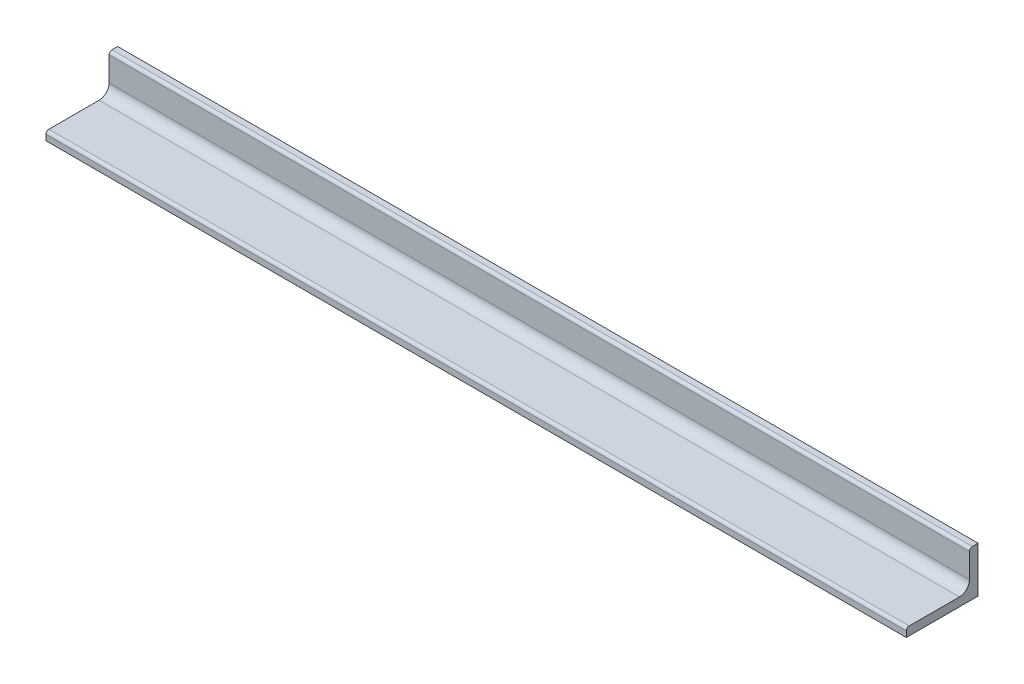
ISO-10303-21;
HEADER;
FILE_DESCRIPTION(('STEP AP214'),'2;1');
FILE_NAME('part.step','',(''),(''),'','','');
FILE_SCHEMA(('AUTOMOTIVE_DESIGN { 1 0 10303 214 1 1 1 1 }'));
ENDSEC;
DATA;
#1=APPLICATION_CONTEXT('core data for automotive mechanical design processes');
#2=APPLICATION_PROTOCOL_DEFINITION('international standard','automotive_design',2000,#1);
#3=PRODUCT_CONTEXT('',#1,'mechanical');
#4=PRODUCT('Part','Part','',(#3));
#5=PRODUCT_RELATED_PRODUCT_CATEGORY('part','',(#4));
#6=PRODUCT_DEFINITION_FORMATION('','',#4);
#7=PRODUCT_DEFINITION_CONTEXT('part definition',#1,'design');
#8=PRODUCT_DEFINITION('design','',#6,#7);
#9=PRODUCT_DEFINITION_SHAPE('','',#8);
#10=(LENGTH_UNIT() NAMED_UNIT(*) SI_UNIT(.MILLI.,.METRE.));
#11=(NAMED_UNIT(*) PLANE_ANGLE_UNIT() SI_UNIT($,.RADIAN.));
#12=(NAMED_UNIT(*) SI_UNIT($,.STERADIAN.) SOLID_ANGLE_UNIT());
#13=UNCERTAINTY_MEASURE_WITH_UNIT(LENGTH_MEASURE(1.E-05),#10,'distance_accuracy_value','');
#14=(GEOMETRIC_REPRESENTATION_CONTEXT(3) GLOBAL_UNCERTAINTY_ASSIGNED_CONTEXT((#13)) GLOBAL_UNIT_ASSIGNED_CONTEXT((#10,
#11,#12)) REPRESENTATION_CONTEXT('',''));
#15=CARTESIAN_POINT('',(0.,0.,0.));
#16=DIRECTION('',(0.,0.,1.));
#17=DIRECTION('',(1.,0.,0.));
#18=AXIS2_PLACEMENT_3D('',#15,#16,#17);
#19=CARTESIAN_POINT('',(300.,0.,25.));
#20=DIRECTION('',(0.,0.,-1.));
#21=DIRECTION('',(0.,1.,0.));
#22=AXIS2_PLACEMENT_3D('',#19,#20,#21);
#23=PLANE('',#22);
#24=DIRECTION('',(0.,-1.,0.));
#25=VECTOR('',#24,1.);
#26=CARTESIAN_POINT('',(0.,0.,25.));
#27=LINE('',#26,#25);
#28=CARTESIAN_POINT('',(0.,2.,25.));
#29=VERTEX_POINT('',#28);
#30=CARTESIAN_POINT('',(0.,0.,25.));
#31=VERTEX_POINT('',#30);
#32=EDGE_CURVE('E135',#29,#31,#27,.T.);
#33=ORIENTED_EDGE('',*,*,#32,.T.);
#34=DIRECTION('',(-1.,0.,0.));
#35=VECTOR('',#34,1.);
#36=CARTESIAN_POINT('',(300.,0.,25.));
#37=LINE('',#36,#35);
#38=CARTESIAN_POINT('',(300.,0.,25.));
#39=VERTEX_POINT('',#38);
#40=EDGE_CURVE('E11',#39,#31,#37,.T.);
#41=ORIENTED_EDGE('',*,*,#40,.F.);
#42=DIRECTION('',(0.,-1.,0.));
#43=VECTOR('',#42,1.);
#44=CARTESIAN_POINT('',(300.,0.,25.));
#45=LINE('',#44,#43);
#46=CARTESIAN_POINT('',(300.,2.,25.));
#47=VERTEX_POINT('',#46);
#48=EDGE_CURVE('E151',#47,#39,#45,.T.);
#49=ORIENTED_EDGE('',*,*,#48,.F.);
#50=DIRECTION('',(-1.,0.,0.));
#51=VECTOR('',#50,1.);
#52=CARTESIAN_POINT('',(300.,2.,25.));
#53=LINE('',#52,#51);
#54=EDGE_CURVE('E131',#47,#29,#53,.T.);
#55=ORIENTED_EDGE('',*,*,#54,.T.);
#56=EDGE_LOOP('',(#33,#41,#49,#55));
#57=FACE_BOUND('',#56,.T.);
#58=ADVANCED_FACE('F33',(#57),#23,.F.);
#59=CARTESIAN_POINT('',(300.,0.,25.));
#60=DIRECTION('',(0.,1.,0.));
#61=DIRECTION('',(0.,0.,1.));
#62=AXIS2_PLACEMENT_3D('',#59,#60,#61);
#63=PLANE('',#62);
#64=DIRECTION('',(0.,0.,-1.));
#65=VECTOR('',#64,1.);
#66=CARTESIAN_POINT('',(0.,0.,25.));
#67=LINE('',#66,#65);
#68=CARTESIAN_POINT('',(0.,0.,0.));
#69=VERTEX_POINT('',#68);
#70=EDGE_CURVE('E138',#31,#69,#67,.T.);
#71=ORIENTED_EDGE('',*,*,#70,.T.);
#72=DIRECTION('',(-1.,0.,0.));
#73=VECTOR('',#72,1.);
#74=CARTESIAN_POINT('',(300.,0.,0.));
#75=LINE('',#74,#73);
#76=CARTESIAN_POINT('',(300.,0.,0.));
#77=VERTEX_POINT('',#76);
#78=EDGE_CURVE('E41',#77,#69,#75,.T.);
#79=ORIENTED_EDGE('',*,*,#78,.F.);
#80=DIRECTION('',(0.,0.,-1.));
#81=VECTOR('',#80,1.);
#82=CARTESIAN_POINT('',(300.,0.,25.));
#83=LINE('',#82,#81);
#84=EDGE_CURVE('E95',#39,#77,#83,.T.);
#85=ORIENTED_EDGE('',*,*,#84,.F.);
#86=ORIENTED_EDGE('',*,*,#40,.T.);
#87=EDGE_LOOP('',(#71,#79,#85,#86));
#88=FACE_BOUND('',#87,.T.);
#89=ADVANCED_FACE('F194',(#88),#63,.F.);
#90=CARTESIAN_POINT('',(300.,0.,0.));
#91=DIRECTION('',(0.,0.,1.));
#92=DIRECTION('',(1.,0.,0.));
#93=AXIS2_PLACEMENT_3D('',#90,#91,#92);
#94=PLANE('',#93);
#95=DIRECTION('',(0.,1.,0.));
#96=VECTOR('',#95,1.);
#97=CARTESIAN_POINT('',(0.,0.,0.));
#98=LINE('',#97,#96);
#99=CARTESIAN_POINT('',(0.,16.,0.));
#100=VERTEX_POINT('',#99);
#101=EDGE_CURVE('E140',#69,#100,#98,.T.);
#102=ORIENTED_EDGE('',*,*,#101,.T.);
#103=DIRECTION('',(-1.,0.,0.));
#104=VECTOR('',#103,1.);
#105=CARTESIAN_POINT('',(300.,16.,0.));
#106=LINE('',#105,#104);
#107=CARTESIAN_POINT('',(300.,16.,0.));
#108=VERTEX_POINT('',#107);
#109=EDGE_CURVE('E161',#108,#100,#106,.T.);
#110=ORIENTED_EDGE('',*,*,#109,.F.);
#111=DIRECTION('',(0.,1.,0.));
#112=VECTOR('',#111,1.);
#113=CARTESIAN_POINT('',(300.,0.,0.));
#114=LINE('',#113,#112);
#115=EDGE_CURVE('E169',#77,#108,#114,.T.);
#116=ORIENTED_EDGE('',*,*,#115,.F.);
#117=ORIENTED_EDGE('',*,*,#78,.T.);
#118=EDGE_LOOP('',(#102,#110,#116,#117));
#119=FACE_BOUND('',#118,.T.);
#120=ADVANCED_FACE('F167',(#119),#94,.F.);
#121=CARTESIAN_POINT('',(300.,16.,0.));
#122=DIRECTION('',(0.,-1.,0.));
#123=DIRECTION('',(0.,0.,-1.));
#124=AXIS2_PLACEMENT_3D('',#121,#122,#123);
#125=PLANE('',#124);
#126=DIRECTION('',(0.,0.,1.));
#127=VECTOR('',#126,1.);
#128=CARTESIAN_POINT('',(0.,16.,0.));
#129=LINE('',#128,#127);
#130=CARTESIAN_POINT('',(0.,16.,2.));
#131=VERTEX_POINT('',#130);
#132=EDGE_CURVE('E142',#100,#131,#129,.T.);
#133=ORIENTED_EDGE('',*,*,#132,.T.);
#134=DIRECTION('',(-1.,0.,0.));
#135=VECTOR('',#134,1.);
#136=CARTESIAN_POINT('',(300.,16.,2.));
#137=LINE('',#136,#135);
#138=CARTESIAN_POINT('',(300.,16.,2.));
#139=VERTEX_POINT('',#138);
#140=EDGE_CURVE('E158',#139,#131,#137,.T.);
#141=ORIENTED_EDGE('',*,*,#140,.F.);
#142=DIRECTION('',(0.,0.,1.));
#143=VECTOR('',#142,1.);
#144=CARTESIAN_POINT('',(300.,16.,0.));
#145=LINE('',#144,#143);
#146=EDGE_CURVE('E185',#108,#139,#145,.T.);
#147=ORIENTED_EDGE('',*,*,#146,.F.);
#148=ORIENTED_EDGE('',*,*,#109,.T.);
#149=EDGE_LOOP('',(#133,#141,#147,#148));
#150=FACE_BOUND('',#149,.T.);
#151=ADVANCED_FACE('F178',(#150),#125,.F.);
#152=CARTESIAN_POINT('',(300.,15.,2.));
#153=DIRECTION('',(-1.,0.,0.));
#154=DIRECTION('',(0.,0.,1.));
#155=AXIS2_PLACEMENT_3D('',#152,#153,#154);
#156=CYLINDRICAL_SURFACE('',#155,0.999999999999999);
#157=CARTESIAN_POINT('',(0.,15.,2.));
#158=DIRECTION('',(1.,0.,0.));
#159=DIRECTION('',(0.,0.,-1.));
#160=AXIS2_PLACEMENT_3D('',#157,#158,#159);
#161=CIRCLE('',#160,0.999999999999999);
#162=CARTESIAN_POINT('',(0.,15.,3.));
#163=VERTEX_POINT('',#162);
#164=EDGE_CURVE('E144',#131,#163,#161,.T.);
#165=ORIENTED_EDGE('',*,*,#164,.T.);
#166=DIRECTION('',(-1.,0.,0.));
#167=VECTOR('',#166,1.);
#168=CARTESIAN_POINT('',(300.,15.,3.));
#169=LINE('',#168,#167);
#170=CARTESIAN_POINT('',(300.,15.,3.));
#171=VERTEX_POINT('',#170);
#172=EDGE_CURVE('E155',#171,#163,#169,.T.);
#173=ORIENTED_EDGE('',*,*,#172,.F.);
#174=CARTESIAN_POINT('',(300.,15.,2.));
#175=DIRECTION('',(1.,0.,0.));
#176=DIRECTION('',(0.,0.,-1.));
#177=AXIS2_PLACEMENT_3D('',#174,#175,#176);
#178=CIRCLE('',#177,0.999999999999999);
#179=EDGE_CURVE('E184',#139,#171,#178,.T.);
#180=ORIENTED_EDGE('',*,*,#179,.F.);
#181=ORIENTED_EDGE('',*,*,#140,.T.);
#182=EDGE_LOOP('',(#165,#173,#180,#181));
#183=FACE_BOUND('',#182,.T.);
#184=ADVANCED_FACE('F182',(#183),#156,.T.);
#185=CARTESIAN_POINT('',(300.,6.50000000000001,2.99999999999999));
#186=DIRECTION('',(0.,0.,-1.));
#187=DIRECTION('',(0.,1.,0.));
#188=AXIS2_PLACEMENT_3D('',#185,#186,#187);
#189=PLANE('',#188);
#190=DIRECTION('',(0.,-1.,0.));
#191=VECTOR('',#190,1.);
#192=CARTESIAN_POINT('',(0.,6.50000000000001,2.99999999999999));
#193=LINE('',#192,#191);
#194=CARTESIAN_POINT('',(0.,6.50000000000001,2.99999999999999));
#195=VERTEX_POINT('',#194);
#196=EDGE_CURVE('E146',#163,#195,#193,.T.);
#197=ORIENTED_EDGE('',*,*,#196,.T.);
#198=DIRECTION('',(-1.,0.,0.));
#199=VECTOR('',#198,1.);
#200=CARTESIAN_POINT('',(300.,6.50000000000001,2.99999999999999));
#201=LINE('',#200,#199);
#202=CARTESIAN_POINT('',(300.,6.50000000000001,2.99999999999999));
#203=VERTEX_POINT('',#202);
#204=EDGE_CURVE('E126',#203,#195,#201,.T.);
#205=ORIENTED_EDGE('',*,*,#204,.F.);
#206=DIRECTION('',(0.,-1.,0.));
#207=VECTOR('',#206,1.);
#208=CARTESIAN_POINT('',(300.,6.50000000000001,2.99999999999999));
#209=LINE('',#208,#207);
#210=EDGE_CURVE('E117',#171,#203,#209,.T.);
#211=ORIENTED_EDGE('',*,*,#210,.F.);
#212=ORIENTED_EDGE('',*,*,#172,.T.);
#213=EDGE_LOOP('',(#197,#205,#211,#212));
#214=FACE_BOUND('',#213,.T.);
#215=ADVANCED_FACE('F206',(#214),#189,.F.);
#216=CARTESIAN_POINT('',(300.,6.5,6.49999999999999));
#217=DIRECTION('',(-1.,0.,0.));
#218=DIRECTION('',(0.,0.,1.));
#219=AXIS2_PLACEMENT_3D('',#216,#217,#218);
#220=CYLINDRICAL_SURFACE('',#219,3.5);
#221=CARTESIAN_POINT('',(0.,6.5,6.49999999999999));
#222=DIRECTION('',(-1.,0.,0.));
#223=DIRECTION('',(0.,0.,-1.));
#224=AXIS2_PLACEMENT_3D('',#221,#222,#223);
#225=CIRCLE('',#224,3.5);
#226=CARTESIAN_POINT('',(0.,3.,6.50000000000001));
#227=VERTEX_POINT('',#226);
#228=EDGE_CURVE('E125',#195,#227,#225,.T.);
#229=ORIENTED_EDGE('',*,*,#228,.T.);
#230=DIRECTION('',(-1.,0.,0.));
#231=VECTOR('',#230,1.);
#232=CARTESIAN_POINT('',(300.,3.,6.50000000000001));
#233=LINE('',#232,#231);
#234=CARTESIAN_POINT('',(300.,3.,6.50000000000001));
#235=VERTEX_POINT('',#234);
#236=EDGE_CURVE('E122',#235,#227,#233,.T.);
#237=ORIENTED_EDGE('',*,*,#236,.F.);
#238=CARTESIAN_POINT('',(300.,6.5,6.49999999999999));
#239=DIRECTION('',(-1.,0.,0.));
#240=DIRECTION('',(0.,0.,-1.));
#241=AXIS2_PLACEMENT_3D('',#238,#239,#240);
#242=CIRCLE('',#241,3.5);
#243=EDGE_CURVE('E111',#203,#235,#242,.T.);
#244=ORIENTED_EDGE('',*,*,#243,.F.);
#245=ORIENTED_EDGE('',*,*,#204,.T.);
#246=EDGE_LOOP('',(#229,#237,#244,#245));
#247=FACE_BOUND('',#246,.T.);
#248=ADVANCED_FACE('F123',(#247),#220,.F.);
#249=CARTESIAN_POINT('',(300.,3.,24.));
#250=DIRECTION('',(0.,-1.,0.));
#251=DIRECTION('',(0.,0.,-1.));
#252=AXIS2_PLACEMENT_3D('',#249,#250,#251);
#253=PLANE('',#252);
#254=DIRECTION('',(0.,0.,1.));
#255=VECTOR('',#254,1.);
#256=CARTESIAN_POINT('',(0.,3.,24.));
#257=LINE('',#256,#255);
#258=CARTESIAN_POINT('',(0.,3.,24.));
#259=VERTEX_POINT('',#258);
#260=EDGE_CURVE('E81',#227,#259,#257,.T.);
#261=ORIENTED_EDGE('',*,*,#260,.T.);
#262=DIRECTION('',(-1.,0.,0.));
#263=VECTOR('',#262,1.);
#264=CARTESIAN_POINT('',(300.,3.,24.));
#265=LINE('',#264,#263);
#266=CARTESIAN_POINT('',(300.,3.,24.));
#267=VERTEX_POINT('',#266);
#268=EDGE_CURVE('E127',#267,#259,#265,.T.);
#269=ORIENTED_EDGE('',*,*,#268,.F.);
#270=DIRECTION('',(0.,0.,1.));
#271=VECTOR('',#270,1.);
#272=CARTESIAN_POINT('',(300.,3.,24.));
#273=LINE('',#272,#271);
#274=EDGE_CURVE('E115',#235,#267,#273,.T.);
#275=ORIENTED_EDGE('',*,*,#274,.F.);
#276=ORIENTED_EDGE('',*,*,#236,.T.);
#277=EDGE_LOOP('',(#261,#269,#275,#276));
#278=FACE_BOUND('',#277,.T.);
#279=ADVANCED_FACE('F129',(#278),#253,.F.);
#280=CARTESIAN_POINT('',(300.,2.,24.));
#281=DIRECTION('',(-1.,0.,0.));
#282=DIRECTION('',(0.,0.,1.));
#283=AXIS2_PLACEMENT_3D('',#280,#281,#282);
#284=CYLINDRICAL_SURFACE('',#283,0.999999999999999);
#285=CARTESIAN_POINT('',(0.,2.,24.));
#286=DIRECTION('',(1.,0.,0.));
#287=DIRECTION('',(0.,0.,1.));
#288=AXIS2_PLACEMENT_3D('',#285,#286,#287);
#289=CIRCLE('',#288,0.999999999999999);
#290=EDGE_CURVE('E87',#259,#29,#289,.T.);
#291=ORIENTED_EDGE('',*,*,#290,.T.);
#292=ORIENTED_EDGE('',*,*,#54,.F.);
#293=CARTESIAN_POINT('',(300.,2.,24.));
#294=DIRECTION('',(1.,0.,0.));
#295=DIRECTION('',(0.,0.,1.));
#296=AXIS2_PLACEMENT_3D('',#293,#294,#295);
#297=CIRCLE('',#296,0.999999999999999);
#298=EDGE_CURVE('E49',#267,#47,#297,.T.);
#299=ORIENTED_EDGE('',*,*,#298,.F.);
#300=ORIENTED_EDGE('',*,*,#268,.T.);
#301=EDGE_LOOP('',(#291,#292,#299,#300));
#302=FACE_BOUND('',#301,.T.);
#303=ADVANCED_FACE('F214',(#302),#284,.T.);
#304=CARTESIAN_POINT('',(300.,2.,24.));
#305=DIRECTION('',(-1.,0.,0.));
#306=DIRECTION('',(0.,0.,1.));
#307=AXIS2_PLACEMENT_3D('',#304,#305,#306);
#308=PLANE('',#307);
#309=ORIENTED_EDGE('',*,*,#48,.T.);
#310=ORIENTED_EDGE('',*,*,#84,.T.);
#311=ORIENTED_EDGE('',*,*,#115,.T.);
#312=ORIENTED_EDGE('',*,*,#146,.T.);
#313=ORIENTED_EDGE('',*,*,#179,.T.);
#314=ORIENTED_EDGE('',*,*,#210,.T.);
#315=ORIENTED_EDGE('',*,*,#243,.T.);
#316=ORIENTED_EDGE('',*,*,#274,.T.);
#317=ORIENTED_EDGE('',*,*,#298,.T.);
#318=EDGE_LOOP('',(#309,#310,#311,#312,#313,#314,#315,#316,#317));
#319=FACE_BOUND('',#318,.T.);
#320=ADVANCED_FACE('F113',(#319),#308,.F.);
#321=CARTESIAN_POINT('',(0.,2.,24.));
#322=DIRECTION('',(-1.,0.,0.));
#323=DIRECTION('',(0.,0.,1.));
#324=AXIS2_PLACEMENT_3D('',#321,#322,#323);
#325=PLANE('',#324);
#326=ORIENTED_EDGE('',*,*,#32,.F.);
#327=ORIENTED_EDGE('',*,*,#290,.F.);
#328=ORIENTED_EDGE('',*,*,#260,.F.);
#329=ORIENTED_EDGE('',*,*,#228,.F.);
#330=ORIENTED_EDGE('',*,*,#196,.F.);
#331=ORIENTED_EDGE('',*,*,#164,.F.);
#332=ORIENTED_EDGE('',*,*,#132,.F.);
#333=ORIENTED_EDGE('',*,*,#101,.F.);
#334=ORIENTED_EDGE('',*,*,#70,.F.);
#335=EDGE_LOOP('',(#326,#327,#328,#329,#330,#331,#332,#333,#334));
#336=FACE_BOUND('',#335,.T.);
#337=ADVANCED_FACE('F173',(#336),#325,.T.);
#338=CLOSED_SHELL('',(#58,#89,#120,#151,#184,#215,#248,#279,#303,#320,#337));
#339=MANIFOLD_SOLID_BREP('B2',#338);
#340=ADVANCED_BREP_SHAPE_REPRESENTATION('',(#18,#339),#14);
#341=SHAPE_DEFINITION_REPRESENTATION(#9,#340);
ENDSEC;
END-ISO-10303-21;
